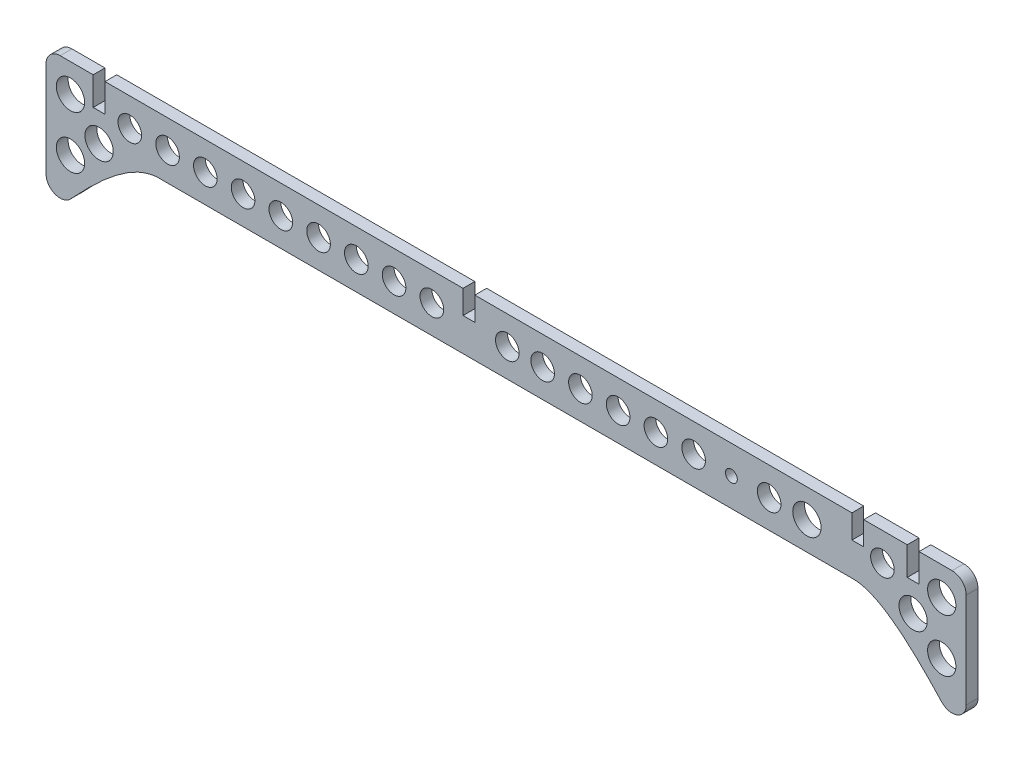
from build123d import *

# Parameters (mm, degrees)
SKETCH1_R           = 3.81
SKETCH1_R_2         = 3.175
SKETCH1_R_3         = 1.5875
BOSS_EXTRUDE1_DEPTH = 3.175


with BuildPart() as part:
    # Sketch1 → Boss-Extrude1 (new body)
    with BuildSketch(Plane.XY):
        with BuildLine():
            Line((107.95, 0), (111.125, 0))
            Line((111.125, 0), (111.125, 7.62))
            Line((111.125, 7.62), (120.015, 7.62))
            ThreePointArc((120.015, 7.62), (122.709076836, 6.504076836), (123.825, 3.81))
            Line((123.825, 3.81), (123.825, 0))
            Line((123.825, 0), (123.825, -21.78469975))
            ThreePointArc((123.825, -21.78469975), (121.419156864, -25.326513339), (117.239990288, -24.395335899))
            add(Edge.make_bspline(
                [(117.239990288, -24.395335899), (110.980979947, -17.742239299), (101.376457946, -7.660342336), (93.469360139, -7.62)],
                knots=[0.386367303, 0.386367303, 0.386367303, 0.386367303, 1, 1, 1, 1], degree=3))
            Line((93.469360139, -7.62), (-93.469360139, -7.62))
            add(Edge.make_bspline(
                [(-117.239990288, -24.395335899), (-110.980979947, -17.742239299), (-101.376457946, -7.660342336), (-93.469360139, -7.62)],
                knots=[0.386367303, 0.386367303, 0.386367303, 0.386367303, 1, 1, 1, 1], degree=3))
            ThreePointArc((-117.239990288, -24.395335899), (-121.419156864, -25.326513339), (-123.825, -21.78469975))
            Line((-123.825, -21.78469975), (-123.825, 0))
            Line((-123.825, 0), (-123.825, 3.81))
            ThreePointArc((-123.825, 3.81), (-122.709076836, 6.504076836), (-120.015, 7.62))
            Line((-120.015, 7.62), (-111.125, 7.62))
            Line((-111.125, 7.62), (-111.125, 0))
            Line((-111.125, 0), (-107.95, 0))
            Line((-107.95, 0), (-107.95, 7.62))
            Line((-107.95, 7.62), (-11.589858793, 7.62))
            Line((-11.589858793, 7.62), (-11.589858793, 1.27))
            Line((-11.589858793, 1.27), (-8.414858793, 1.27))
            Line((-8.414858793, 1.27), (-8.414858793, 7.62))
            Line((-8.414858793, 7.62), (93.073058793, 7.62))
            Line((93.073058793, 7.62), (93.073058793, 1.27))
            Line((93.073058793, 1.27), (96.248058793, 1.27))
            Line((96.248058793, 1.27), (96.248058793, 7.62))
            Line((96.248058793, 7.62), (107.95, 7.62))
            Line((107.95, 7.62), (107.95, 0))
        make_face()
        with Locations((-117.239990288, 0)):
            Circle(SKETCH1_R, mode=Mode.SUBTRACT)
        with Locations((-101.271287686, 0)):
            Circle(SKETCH1_R_2, mode=Mode.SUBTRACT)
        with Locations((-91.111287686, 0)):
            Circle(SKETCH1_R_2, mode=Mode.SUBTRACT)
        with Locations((-80.951287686, 0)):
            Circle(SKETCH1_R_2, mode=Mode.SUBTRACT)
        with Locations((-70.791287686, 0)):
            Circle(SKETCH1_R_2, mode=Mode.SUBTRACT)
        with Locations((-60.631287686, 0)):
            Circle(SKETCH1_R_2, mode=Mode.SUBTRACT)
        with Locations((-50.471287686, 0)):
            Circle(SKETCH1_R_2, mode=Mode.SUBTRACT)
        with Locations((-40.311287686, 0)):
            Circle(SKETCH1_R_2, mode=Mode.SUBTRACT)
        with Locations((-30.151287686, 0)):
            Circle(SKETCH1_R_2, mode=Mode.SUBTRACT)
        with Locations((-19.991287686, 0)):
            Circle(SKETCH1_R_2, mode=Mode.SUBTRACT)
        with Locations((0.328712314, 0)):
            Circle(SKETCH1_R_2, mode=Mode.SUBTRACT)
        with Locations(Location((9.831287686, 0, 0), (0, 0, 180))):
            Circle(SKETCH1_R_2, mode=Mode.SUBTRACT)
        with Locations(Location((19.991287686, 0, 0), (0, 0, 180))):
            Circle(SKETCH1_R_2, mode=Mode.SUBTRACT)
        with Locations(Location((30.151287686, 0, 0), (0, 0, 180))):
            Circle(SKETCH1_R_2, mode=Mode.SUBTRACT)
        with Locations(Location((40.311287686, 0, 0), (0, 0, 180))):
            Circle(SKETCH1_R_2, mode=Mode.SUBTRACT)
        with Locations(Location((50.471287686, 0, 0), (0, 0, 180))):
            Circle(SKETCH1_R_2, mode=Mode.SUBTRACT)
        with Locations(Location((70.791287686, 0, 0), (0, 0, 180))):
            Circle(SKETCH1_R_2, mode=Mode.SUBTRACT)
        with Locations(Location((80.951287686, 0, 0), (0, 0, 180))):
            Circle(SKETCH1_R, mode=Mode.SUBTRACT)
        with Locations(Location((101.271287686, 0, 0), (0, 0, 180))):
            Circle(SKETCH1_R_2, mode=Mode.SUBTRACT)
        with Locations(Location((117.239990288, 0, 0), (0, 0, 180))):
            Circle(SKETCH1_R, mode=Mode.SUBTRACT)
        with Locations((-109.5375, -7.62)):
            Circle(SKETCH1_R, mode=Mode.SUBTRACT)
        with Locations((-117.239990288, -14.212538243)):
            Circle(SKETCH1_R, mode=Mode.SUBTRACT)
        with Locations(Location((117.239990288, -14.212538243, 0), (0, 0, 180))):
            Circle(SKETCH1_R, mode=Mode.SUBTRACT)
        with Locations(Location((109.5375, -7.62, 0), (0, 0, 180))):
            Circle(SKETCH1_R, mode=Mode.SUBTRACT)
        with Locations((60.631287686, 0)):
            Circle(SKETCH1_R_3, mode=Mode.SUBTRACT)
    extrude(amount=BOSS_EXTRUDE1_DEPTH)


solid = part.part
